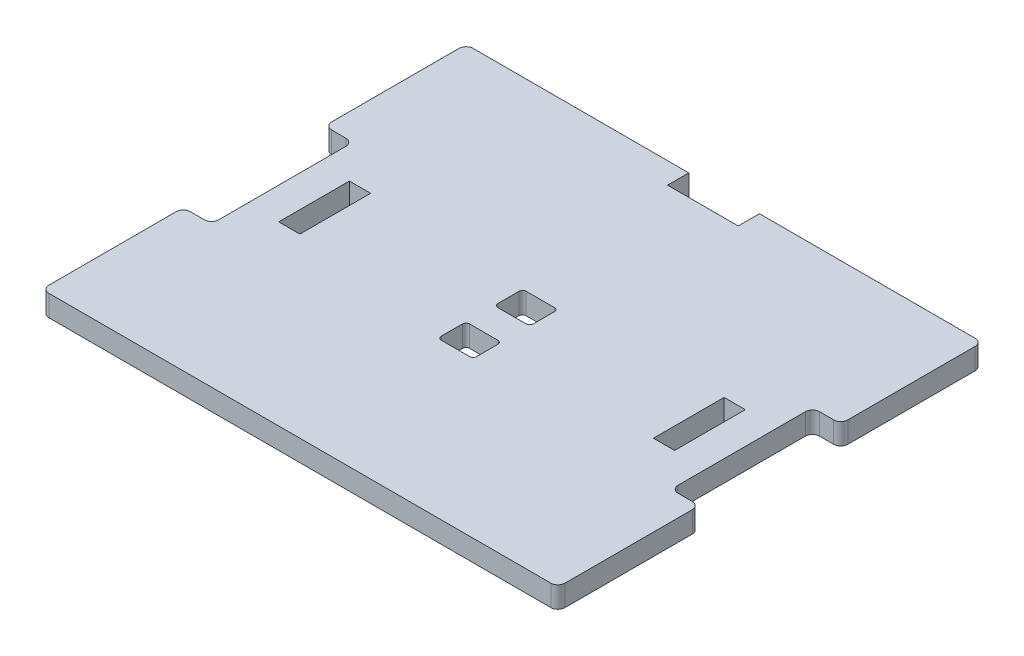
from build123d import *

# Parameters (mm, degrees)
BOSS_EXTRUDE1_DEPTH     = 6
FILLET1_R               = 2
CUT_EXTRUDE1_DEPTH      = 95.683683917
CUT_EXTRUDE1_DEPTH_BACK = 95.683683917
SKETCH2_W               = 6
SKETCH2_H               = 20
SKETCH3_W               = 10
SKETCH3_H               = 8
CUT_EXTRUDE2_DEPTH      = 95.683683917
FILLET2_R               = 1
SKETCH4_W               = 20
SKETCH4_H               = 6
CUT_EXTRUDE3_DEPTH      = 95.683683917


with BuildPart() as part:
    # Sketch1 → Boss-Extrude1 (new body)
    with BuildSketch(Plane(origin=(0, 0, 0), x_dir=(1, 0, 0), z_dir=(0, 1, 0))):
        Polygon((65, 20), (65, -20), (73, -20), (73, -60), (-73, -60), (-73, -20), (-65, -20), (-65, 20), (-73, 20), (-73, 60), (73, 60), (73, 20), align=None)
    extrude(amount=BOSS_EXTRUDE1_DEPTH)

    # Fillet1
    fillet1_edges = [part.edges().sort_by_distance(p)[0] for p in [
        (65, 3, 20),
        (73, 3, 20),
        (73, 3, 60),
        (-73, 3, 60),
        (-73, 3, 20),
        (-65, 3, 20),
        (-65, 3, -20),
        (-73, 3, -20),
        (-73, 3, -60),
        (73, 3, -60),
        (73, 3, -20),
        (65, 3, -20),
    ]]
    fillet(fillet1_edges, radius=FILLET1_R)

    # Sketch2 → Cut-Extrude1 (cut, two sides: drawn at the far end of the back side and taken through both)
    with BuildSketch(Plane(origin=(0, 6, 0), x_dir=(1, 0, 0), z_dir=(0, 1, 0)).offset(-CUT_EXTRUDE1_DEPTH_BACK)):
        with Locations((53, 0)):
            Rectangle(SKETCH2_W, SKETCH2_H)
        with Locations((-53, 0)):
            Rectangle(SKETCH2_W, SKETCH2_H)
    extrude(amount=CUT_EXTRUDE1_DEPTH + CUT_EXTRUDE1_DEPTH_BACK, mode=Mode.SUBTRACT)

    # Sketch3 → Cut-Extrude2 (cut, through all)
    with BuildSketch(Plane(origin=(0, 6, 0), x_dir=(1, 0, 0), z_dir=(0, 1, 0))):
        with Locations((0, 4)):
            Rectangle(SKETCH3_W, SKETCH3_H)
        with Locations((0, -12)):
            Rectangle(SKETCH3_W, SKETCH3_H)
    extrude(amount=-CUT_EXTRUDE2_DEPTH, mode=Mode.SUBTRACT)

    # Fillet2
    fillet2_edges = [part.edges().sort_by_distance(p)[0] for p in [
        (5, 3, -8),
        (5, 3, 0),
        (-5, 3, 0),
        (-5, 3, -8),
        (-5, 3, 16),
        (-5, 3, 8),
        (5, 3, 8),
        (5, 3, 16),
    ]]
    fillet(fillet2_edges, radius=FILLET2_R)

    # Sketch4 → Cut-Extrude3 (cut, through all)
    with BuildSketch(Plane(origin=(0, 6, 0), x_dir=(1, 0, 0), z_dir=(0, 1, 0))):
        with Locations((0, 57)):
            Rectangle(SKETCH4_W, SKETCH4_H)
    extrude(amount=-CUT_EXTRUDE3_DEPTH, mode=Mode.SUBTRACT)


solid = part.part
